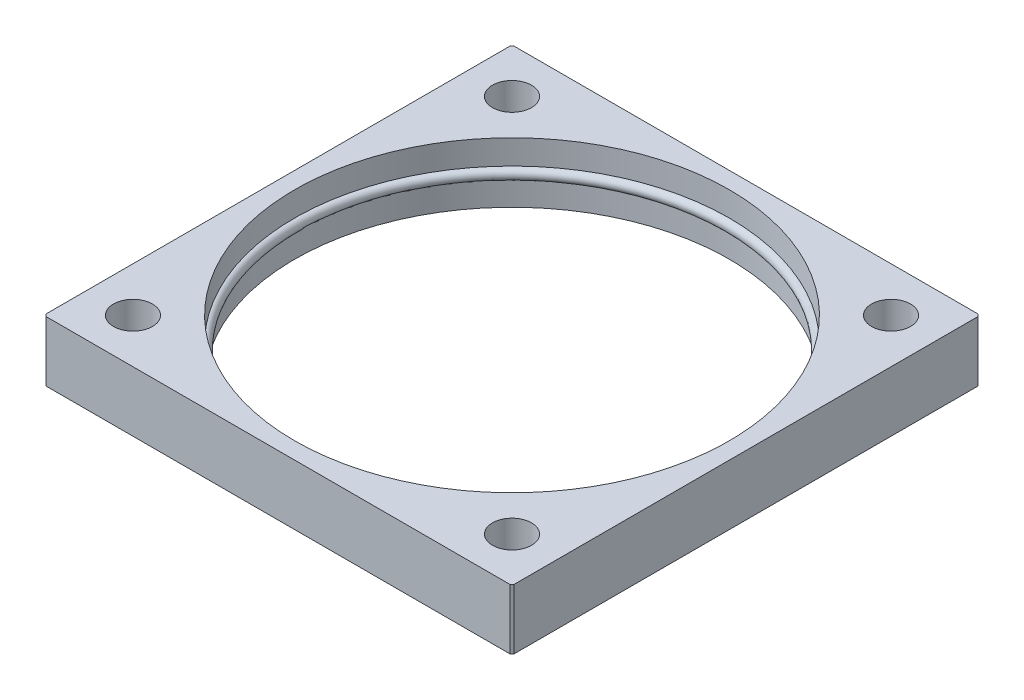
from build123d import *

# Parameters (mm, degrees)
SKETCH1_R           = 97.5
SKETCH1_R_2         = 8.75
BOSS_EXTRUDE1_DEPTH = 13.5
SKETCH2_R           = 2.5


with BuildPart() as part:
    # Sketch1 → Boss-Extrude1 (new, symmetric)
    with BuildSketch(Plane(origin=(0, 0, 0), x_dir=(1, 0, 0), z_dir=(0, 1, 0))):
        Polygon((-105, 104), (-104, 105), (104, 105), (105, 104), (105, -104), (104, -105), (-104, -105), (-105, -104), align=None)
        with Locations(Location((0, 0, 0), (0, 0, 270))):
            Circle(SKETCH1_R, mode=Mode.SUBTRACT)
        with Locations(Location((-85, 85, 0), (0, 0, 270))):
            Circle(SKETCH1_R_2, mode=Mode.SUBTRACT)
        with Locations(Location((85, 85, 0), (0, 0, 270))):
            Circle(SKETCH1_R_2, mode=Mode.SUBTRACT)
        with Locations(Location((85, -85, 0), (0, 0, 270))):
            Circle(SKETCH1_R_2, mode=Mode.SUBTRACT)
        with Locations(Location((-85, -85, 0), (0, 0, 270))):
            Circle(SKETCH1_R_2, mode=Mode.SUBTRACT)
    extrude(amount=BOSS_EXTRUDE1_DEPTH, both=True)

    # Sketch2 → Revolve1 (revolve)
    with BuildSketch(Plane.XY, mode=Mode.PRIVATE) as revolve1_sk:
        with Locations((-97.5, 0)):
            Circle(SKETCH2_R)
    revolve(revolve1_sk.sketch.rotate(Axis((0, 0, 0), (0, 1, 0)), 270), axis=Axis((0, 0, 0), (0, 1, 0)))


solid = part.part
